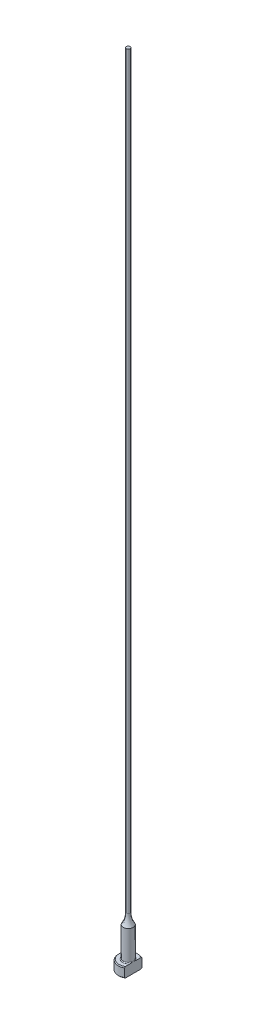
ISO-10303-21;
HEADER;
FILE_DESCRIPTION(('STEP AP214'),'2;1');
FILE_NAME('part.step','',(''),(''),'','','');
FILE_SCHEMA(('AUTOMOTIVE_DESIGN { 1 0 10303 214 1 1 1 1 }'));
ENDSEC;
DATA;
#1=APPLICATION_CONTEXT('core data for automotive mechanical design processes');
#2=APPLICATION_PROTOCOL_DEFINITION('international standard','automotive_design',2000,#1);
#3=PRODUCT_CONTEXT('',#1,'mechanical');
#4=PRODUCT('Part','Part','',(#3));
#5=PRODUCT_RELATED_PRODUCT_CATEGORY('part','',(#4));
#6=PRODUCT_DEFINITION_FORMATION('','',#4);
#7=PRODUCT_DEFINITION_CONTEXT('part definition',#1,'design');
#8=PRODUCT_DEFINITION('design','',#6,#7);
#9=PRODUCT_DEFINITION_SHAPE('','',#8);
#10=(LENGTH_UNIT() NAMED_UNIT(*) SI_UNIT(.MILLI.,.METRE.));
#11=(NAMED_UNIT(*) PLANE_ANGLE_UNIT() SI_UNIT($,.RADIAN.));
#12=(NAMED_UNIT(*) SI_UNIT($,.STERADIAN.) SOLID_ANGLE_UNIT());
#13=UNCERTAINTY_MEASURE_WITH_UNIT(LENGTH_MEASURE(1.E-05),#10,'distance_accuracy_value','');
#14=(GEOMETRIC_REPRESENTATION_CONTEXT(3) GLOBAL_UNCERTAINTY_ASSIGNED_CONTEXT((#13)) GLOBAL_UNIT_ASSIGNED_CONTEXT((#10,
#11,#12)) REPRESENTATION_CONTEXT('',''));
#15=CARTESIAN_POINT('',(0.,0.,0.));
#16=DIRECTION('',(0.,0.,1.));
#17=DIRECTION('',(1.,0.,0.));
#18=AXIS2_PLACEMENT_3D('',#15,#16,#17);
#19=CARTESIAN_POINT('',(-3.17499999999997,3.175,0.));
#20=DIRECTION('',(0.,1.,0.));
#21=DIRECTION('',(0.,0.,1.));
#22=AXIS2_PLACEMENT_3D('',#19,#20,#21);
#23=PLANE('',#22);
#24=CARTESIAN_POINT('',(0.,3.175,0.));
#25=DIRECTION('',(0.,1.,0.));
#26=DIRECTION('',(0.,0.,1.));
#27=AXIS2_PLACEMENT_3D('',#24,#25,#26);
#28=CIRCLE('',#27,2.92099999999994);
#29=CARTESIAN_POINT('',(1.58749999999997,3.175,-2.45195529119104));
#30=VERTEX_POINT('',#29);
#31=CARTESIAN_POINT('',(1.58749999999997,3.175,2.45195529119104));
#32=VERTEX_POINT('',#31);
#33=EDGE_CURVE('E105',#30,#32,#28,.T.);
#34=ORIENTED_EDGE('',*,*,#33,.T.);
#35=DIRECTION('',(0.,0.,1.));
#36=VECTOR('',#35,1.);
#37=CARTESIAN_POINT('',(1.58749999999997,3.17499999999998,2.74963065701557));
#38=LINE('',#37,#36);
#39=CARTESIAN_POINT('',(1.58749999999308,3.175,0.933255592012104));
#40=VERTEX_POINT('',#39);
#41=EDGE_CURVE('E126',#40,#32,#38,.T.);
#42=ORIENTED_EDGE('',*,*,#41,.F.);
#43=CARTESIAN_POINT('',(0.,3.175,0.));
#44=DIRECTION('',(0.,1.,0.));
#45=DIRECTION('',(0.,0.,1.));
#46=AXIS2_PLACEMENT_3D('',#43,#44,#45);
#47=CIRCLE('',#46,1.84149999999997);
#48=CARTESIAN_POINT('',(1.58749999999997,3.17500000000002,-0.933255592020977));
#49=VERTEX_POINT('',#48);
#50=EDGE_CURVE('E11',#40,#49,#47,.F.);
#51=ORIENTED_EDGE('',*,*,#50,.T.);
#52=EDGE_CURVE('E52',#30,#49,#38,.T.);
#53=ORIENTED_EDGE('',*,*,#52,.F.);
#54=EDGE_LOOP('',(#34,#42,#51,#53));
#55=FACE_BOUND('',#54,.T.);
#56=ADVANCED_FACE('F32',(#55),#23,.T.);
#57=CARTESIAN_POINT('',(0.,259.958771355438,0.));
#58=DIRECTION('',(0.,1.,0.));
#59=DIRECTION('',(0.,0.,1.));
#60=AXIS2_PLACEMENT_3D('',#57,#58,#59);
#61=CYLINDRICAL_SURFACE('',#60,3.17499999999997);
#62=CARTESIAN_POINT('',(0.,2.92100000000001,0.));
#63=DIRECTION('',(0.,1.,0.));
#64=DIRECTION('',(0.,0.,1.));
#65=AXIS2_PLACEMENT_3D('',#62,#63,#64);
#66=CIRCLE('',#65,3.17499999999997);
#67=CARTESIAN_POINT('',(1.58749999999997,2.92100000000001,2.74963065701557));
#68=VERTEX_POINT('',#67);
#69=CARTESIAN_POINT('',(1.58749999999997,2.92100000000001,-2.74963065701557));
#70=VERTEX_POINT('',#69);
#71=EDGE_CURVE('E98',#68,#70,#66,.F.);
#72=ORIENTED_EDGE('',*,*,#71,.T.);
#73=DIRECTION('',(0.,-1.,0.));
#74=VECTOR('',#73,1.);
#75=CARTESIAN_POINT('',(1.58749999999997,254.001,-2.74963065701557));
#76=LINE('',#75,#74);
#77=CARTESIAN_POINT('',(1.58749999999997,0.253999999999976,-2.74963065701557));
#78=VERTEX_POINT('',#77);
#79=EDGE_CURVE('E141',#70,#78,#76,.T.);
#80=ORIENTED_EDGE('',*,*,#79,.T.);
#81=CARTESIAN_POINT('',(0.,0.253999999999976,0.));
#82=DIRECTION('',(0.,-1.,0.));
#83=DIRECTION('',(0.,0.,-1.));
#84=AXIS2_PLACEMENT_3D('',#81,#82,#83);
#85=CIRCLE('',#84,3.17499999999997);
#86=CARTESIAN_POINT('',(1.58749999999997,0.253999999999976,2.74963065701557));
#87=VERTEX_POINT('',#86);
#88=EDGE_CURVE('E95',#78,#87,#85,.F.);
#89=ORIENTED_EDGE('',*,*,#88,.T.);
#90=DIRECTION('',(0.,-1.,0.));
#91=VECTOR('',#90,1.);
#92=CARTESIAN_POINT('',(1.58749999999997,254.001,2.74963065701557));
#93=LINE('',#92,#91);
#94=EDGE_CURVE('E88',#68,#87,#93,.T.);
#95=ORIENTED_EDGE('',*,*,#94,.F.);
#96=EDGE_LOOP('',(#72,#80,#89,#95));
#97=FACE_BOUND('',#96,.T.);
#98=ADVANCED_FACE('F191',(#97),#61,.T.);
#99=CARTESIAN_POINT('',(0.,0.,0.));
#100=DIRECTION('',(0.,-1.,0.));
#101=DIRECTION('',(0.,0.,-1.));
#102=AXIS2_PLACEMENT_3D('',#99,#100,#101);
#103=PLANE('',#102);
#104=CARTESIAN_POINT('',(0.,0.,0.));
#105=DIRECTION('',(0.,-1.,0.));
#106=DIRECTION('',(0.,0.,-1.));
#107=AXIS2_PLACEMENT_3D('',#104,#105,#106);
#108=CIRCLE('',#107,2.92100000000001);
#109=CARTESIAN_POINT('',(1.58749999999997,0.,2.45195529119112));
#110=VERTEX_POINT('',#109);
#111=CARTESIAN_POINT('',(1.58749999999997,0.,-2.45195529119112));
#112=VERTEX_POINT('',#111);
#113=EDGE_CURVE('E93',#110,#112,#108,.T.);
#114=ORIENTED_EDGE('',*,*,#113,.T.);
#115=DIRECTION('',(0.,0.,1.));
#116=VECTOR('',#115,1.);
#117=CARTESIAN_POINT('',(1.58749999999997,0.,2.74963065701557));
#118=LINE('',#117,#116);
#119=EDGE_CURVE('E78',#112,#110,#118,.T.);
#120=ORIENTED_EDGE('',*,*,#119,.T.);
#121=EDGE_LOOP('',(#114,#120));
#122=FACE_BOUND('',#121,.T.);
#123=ADVANCED_FACE('F97',(#122),#103,.T.);
#124=CARTESIAN_POINT('',(0.,3.17499999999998,0.));
#125=DIRECTION('',(0.,-1.,0.));
#126=DIRECTION('',(0.,0.,-1.));
#127=AXIS2_PLACEMENT_3D('',#124,#125,#126);
#128=CONICAL_SURFACE('',#127,2.92099999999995,0.785398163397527);
#129=ORIENTED_EDGE('',*,*,#71,.F.);
#130=CARTESIAN_POINT('',(1.58749999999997,-0.16162066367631,-6.0529050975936));
#131=CARTESIAN_POINT('',(1.58749999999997,-0.0288893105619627,-5.91567682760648));
#132=CARTESIAN_POINT('',(1.58749999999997,0.103699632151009,-5.7783103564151));
#133=CARTESIAN_POINT('',(1.58749999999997,0.368508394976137,-5.50321874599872));
#134=CARTESIAN_POINT('',(1.58749999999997,0.500728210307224,-5.36549360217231));
#135=CARTESIAN_POINT('',(1.58749999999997,0.764778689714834,-5.08953516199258));
#136=CARTESIAN_POINT('',(1.58749999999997,0.896609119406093,-4.9513016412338));
#137=CARTESIAN_POINT('',(1.58749999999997,1.15968706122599,-4.67428233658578));
#138=CARTESIAN_POINT('',(1.58749999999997,1.29093457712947,-4.53549655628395));
#139=CARTESIAN_POINT('',(1.58749999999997,1.55007705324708,-4.25997724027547));
#140=CARTESIAN_POINT('',(1.58749999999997,1.67798684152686,-4.12325766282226));
#141=CARTESIAN_POINT('',(1.58749999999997,1.9328486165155,-3.84892898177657));
#142=CARTESIAN_POINT('',(1.58749999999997,2.05980060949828,-3.71131988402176));
#143=CARTESIAN_POINT('',(1.58749999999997,2.31237508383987,-3.43493978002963));
#144=CARTESIAN_POINT('',(1.58749999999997,2.43799784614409,-3.29616903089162));
#145=CARTESIAN_POINT('',(1.58749999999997,2.68741369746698,-3.01699558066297));
#146=CARTESIAN_POINT('',(1.58749999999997,2.81120686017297,-2.8765929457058));
#147=CARTESIAN_POINT('',(1.58749999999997,3.00875865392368,-2.64816703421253));
#148=CARTESIAN_POINT('',(1.58749999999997,3.08336151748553,-2.56087478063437));
#149=CARTESIAN_POINT('',(1.58749999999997,3.2312387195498,-2.38515423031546));
#150=CARTESIAN_POINT('',(1.58749999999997,3.30451292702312,-2.29672582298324));
#151=CARTESIAN_POINT('',(1.58749999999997,3.45004422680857,-2.1174740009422));
#152=CARTESIAN_POINT('',(1.58749999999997,3.5222823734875,-2.02663514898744));
#153=CARTESIAN_POINT('',(1.58749999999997,3.66423097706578,-1.8430252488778));
#154=CARTESIAN_POINT('',(1.58749999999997,3.73394203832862,-1.75025467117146));
#155=CARTESIAN_POINT('',(1.58749999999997,3.87080633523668,-1.5606747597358));
#156=CARTESIAN_POINT('',(1.58749999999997,3.93790459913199,-1.46382547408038));
#157=CARTESIAN_POINT('',(1.58749999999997,4.06669147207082,-1.26632594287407));
#158=CARTESIAN_POINT('',(1.58749999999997,4.1283726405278,-1.16567073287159));
#159=CARTESIAN_POINT('',(1.58749999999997,4.21402252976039,-1.01165766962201));
#160=CARTESIAN_POINT('',(1.58749999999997,4.24127929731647,-0.960142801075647));
#161=CARTESIAN_POINT('',(1.58749999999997,4.2930979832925,-0.855780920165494));
#162=CARTESIAN_POINT('',(1.58749999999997,4.31765941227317,-0.802933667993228));
#163=CARTESIAN_POINT('',(1.58749999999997,4.38614656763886,-0.642461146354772));
#164=CARTESIAN_POINT('',(1.58749999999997,4.42510149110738,-0.532518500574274));
#165=CARTESIAN_POINT('',(1.58749999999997,4.46726244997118,-0.367680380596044));
#166=CARTESIAN_POINT('',(1.58749999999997,4.47844427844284,-0.314802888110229));
#167=CARTESIAN_POINT('',(1.58749999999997,4.49576654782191,-0.208209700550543));
#168=CARTESIAN_POINT('',(1.58749999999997,4.50190743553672,-0.154494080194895));
#169=CARTESIAN_POINT('',(1.58749999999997,4.50871296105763,-0.0468792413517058));
#170=CARTESIAN_POINT('',(1.58749999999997,4.5093945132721,0.00701889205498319));
#171=CARTESIAN_POINT('',(1.58749999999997,4.50527679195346,0.114606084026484));
#172=CARTESIAN_POINT('',(1.58749999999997,4.50047706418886,0.168295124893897));
#173=CARTESIAN_POINT('',(1.58749999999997,4.48579689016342,0.27448544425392));
#174=CARTESIAN_POINT('',(1.58749999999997,4.47596081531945,0.32699298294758));
#175=CARTESIAN_POINT('',(1.58749999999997,4.45181809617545,0.430974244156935));
#176=CARTESIAN_POINT('',(1.58749999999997,4.4375096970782,0.482447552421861));
#177=CARTESIAN_POINT('',(1.58749999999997,4.40502489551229,0.584460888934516));
#178=CARTESIAN_POINT('',(1.58749999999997,4.386827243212,0.634994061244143));
#179=CARTESIAN_POINT('',(1.58749999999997,4.34729308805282,0.734789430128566));
#180=CARTESIAN_POINT('',(1.58749999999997,4.3259572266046,0.784051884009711));
#181=CARTESIAN_POINT('',(1.58749999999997,4.25791922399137,0.930549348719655));
#182=CARTESIAN_POINT('',(1.58749999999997,4.20736047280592,1.0259880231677));
#183=CARTESIAN_POINT('',(1.58749999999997,4.0995545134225,1.21304313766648));
#184=CARTESIAN_POINT('',(1.58749999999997,4.04229912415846,1.30465471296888));
#185=CARTESIAN_POINT('',(1.58749999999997,3.92308746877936,1.48526211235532));
#186=CARTESIAN_POINT('',(1.58749999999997,3.86111349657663,1.57424615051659));
#187=CARTESIAN_POINT('',(1.58749999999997,3.73408621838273,1.74990003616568));
#188=CARTESIAN_POINT('',(1.58749999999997,3.66903444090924,1.83657099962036));
#189=CARTESIAN_POINT('',(1.58749999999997,3.53583371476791,2.00931764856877));
#190=CARTESIAN_POINT('',(1.58749999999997,3.46765527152,2.09537048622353));
#191=CARTESIAN_POINT('',(1.58749999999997,3.32960643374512,2.26611736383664));
#192=CARTESIAN_POINT('',(1.58749999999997,3.25973586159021,2.35081125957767));
#193=CARTESIAN_POINT('',(1.58749999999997,3.04858139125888,2.60290121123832));
#194=CARTESIAN_POINT('',(1.58749999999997,2.90542388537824,2.76872537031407));
#195=CARTESIAN_POINT('',(1.58749999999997,2.64069522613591,3.06970913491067));
#196=CARTESIAN_POINT('',(1.58749999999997,2.51959458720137,3.20528660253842));
#197=CARTESIAN_POINT('',(1.58749999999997,2.27590400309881,3.47510321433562));
#198=CARTESIAN_POINT('',(1.58749999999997,2.15331401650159,3.60934232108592));
#199=CARTESIAN_POINT('',(1.58749999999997,1.90694239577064,3.87695374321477));
#200=CARTESIAN_POINT('',(1.58749999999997,1.78315974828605,4.0103251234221));
#201=CARTESIAN_POINT('',(1.58749999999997,1.53478104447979,4.27630880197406));
#202=CARTESIAN_POINT('',(1.58749999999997,1.41018498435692,4.40892109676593));
#203=CARTESIAN_POINT('',(1.58749999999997,1.0457468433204,4.79499418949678));
#204=CARTESIAN_POINT('',(1.58749999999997,0.80507680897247,5.04767313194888));
#205=CARTESIAN_POINT('',(1.58749999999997,0.443121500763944,5.42550911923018));
#206=CARTESIAN_POINT('',(1.58749999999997,0.322378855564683,5.55118772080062));
#207=CARTESIAN_POINT('',(1.58749999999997,0.0805914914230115,5.80225207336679));
#208=CARTESIAN_POINT('',(1.58749999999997,-0.040453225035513,5.92763782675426));
#209=CARTESIAN_POINT('',(1.58749999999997,-0.161620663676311,6.0529050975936));
#210=B_SPLINE_CURVE_WITH_KNOTS('',3,(#130,#131,#132,#133,#134,#135,#136,#137,#138,#139,#140,
#141,#142,#143,#144,#145,#146,#147,#148,#149,#150,#151,#152,#153,#154,#155,#156,#157,#158,#159,
#160,#161,#162,#163,#164,#165,#166,#167,#168,#169,#170,#171,#172,#173,#174,#175,#176,#177,#178,
#179,#180,#181,#182,#183,#184,#185,#186,#187,#188,#189,#190,#191,#192,#193,#194,#195,#196,#197,
#198,#199,#200,#201,#202,#203,#204,#205,#206,#207,#208,#209),.UNSPECIFIED.,.F.,.F.,(4,2,2,2,2,2,
2,2,2,2,2,2,2,2,2,2,2,2,2,2,2,2,2,2,2,2,2,2,2,2,2,2,2,2,2,2,2,2,2,4),(0.,0.572750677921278,
1.14550874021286,1.71856057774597,2.29160869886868,2.85328006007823,3.4149477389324,
3.97649423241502,4.53801804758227,4.88249307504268,5.22700189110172,5.5751532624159,
5.92322081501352,6.27657800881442,6.63041319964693,6.80518126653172,6.9799810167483,
7.3282426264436,7.49018491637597,7.65211285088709,7.81353889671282,7.97497832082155,
8.13501929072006,8.29512313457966,8.45612518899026,8.61709438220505,8.94062993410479,
9.2645649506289,9.58978187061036,9.91483894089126,10.2441741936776,10.5735441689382,
11.2306812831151,11.7760337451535,12.3214014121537,12.8672825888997,13.4131663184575,
14.4600164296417,14.9828595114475,15.5056983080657),.UNSPECIFIED.);
#211=EDGE_CURVE('E118',#32,#68,#210,.T.);
#212=ORIENTED_EDGE('',*,*,#211,.F.);
#213=ORIENTED_EDGE('',*,*,#33,.F.);
#214=EDGE_CURVE('E117',#70,#30,#210,.T.);
#215=ORIENTED_EDGE('',*,*,#214,.F.);
#216=EDGE_LOOP('',(#129,#212,#213,#215));
#217=FACE_BOUND('',#216,.T.);
#218=ADVANCED_FACE('F162',(#217),#128,.T.);
#219=CARTESIAN_POINT('',(0.,0.253999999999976,0.));
#220=DIRECTION('',(0.,1.,0.));
#221=DIRECTION('',(0.,0.,1.));
#222=AXIS2_PLACEMENT_3D('',#219,#220,#221);
#223=CONICAL_SURFACE('',#222,3.17499999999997,0.785398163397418);
#224=ORIENTED_EDGE('',*,*,#88,.F.);
#225=CARTESIAN_POINT('',(1.58749999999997,3.33662066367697,6.0529050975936));
#226=CARTESIAN_POINT('',(1.58749999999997,3.20388931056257,5.91567682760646));
#227=CARTESIAN_POINT('',(1.58749999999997,3.07130036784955,5.77831035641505));
#228=CARTESIAN_POINT('',(1.58749999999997,2.80649160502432,5.50321874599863));
#229=CARTESIAN_POINT('',(1.58749999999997,2.67427178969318,5.3654936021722));
#230=CARTESIAN_POINT('',(1.58749999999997,2.41022131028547,5.08953516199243));
#231=CARTESIAN_POINT('',(1.58749999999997,2.27839088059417,4.95130164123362));
#232=CARTESIAN_POINT('',(1.58749999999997,2.01531293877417,4.67428233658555));
#233=CARTESIAN_POINT('',(1.58749999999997,1.88406542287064,4.5354965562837));
#234=CARTESIAN_POINT('',(1.58749999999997,1.62492294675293,4.25997724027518));
#235=CARTESIAN_POINT('',(1.58749999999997,1.49701315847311,4.12325766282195));
#236=CARTESIAN_POINT('',(1.58749999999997,1.24215138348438,3.84892898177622));
#237=CARTESIAN_POINT('',(1.58749999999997,1.11519939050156,3.71131988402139));
#238=CARTESIAN_POINT('',(1.58749999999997,0.862624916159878,3.43493978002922));
#239=CARTESIAN_POINT('',(1.58749999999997,0.737002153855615,3.29616903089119));
#240=CARTESIAN_POINT('',(1.58749999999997,0.487586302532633,3.01699558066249));
#241=CARTESIAN_POINT('',(1.58749999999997,0.363793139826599,2.8765929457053));
#242=CARTESIAN_POINT('',(1.58749999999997,0.166241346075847,2.64816703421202));
#243=CARTESIAN_POINT('',(1.58749999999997,0.0916384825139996,2.56087478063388));
#244=CARTESIAN_POINT('',(1.58749999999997,-0.0562387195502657,2.385154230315));
#245=CARTESIAN_POINT('',(1.58749999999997,-0.129512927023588,2.29672582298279));
#246=CARTESIAN_POINT('',(1.58749999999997,-0.27504422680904,2.11747400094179));
#247=CARTESIAN_POINT('',(1.58749999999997,-0.347282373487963,2.02663514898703));
#248=CARTESIAN_POINT('',(1.58749999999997,-0.489230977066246,1.84302524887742));
#249=CARTESIAN_POINT('',(1.58749999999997,-0.558942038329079,1.7502546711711));
#250=CARTESIAN_POINT('',(1.58749999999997,-0.695806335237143,1.56067475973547));
#251=CARTESIAN_POINT('',(1.58749999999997,-0.762904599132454,1.46382547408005));
#252=CARTESIAN_POINT('',(1.58749999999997,-0.891691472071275,1.26632594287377));
#253=CARTESIAN_POINT('',(1.58749999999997,-0.953372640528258,1.16567073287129));
#254=CARTESIAN_POINT('',(1.58749999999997,-1.03902252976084,1.01165766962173));
#255=CARTESIAN_POINT('',(1.58749999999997,-1.06627929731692,0.960142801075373));
#256=CARTESIAN_POINT('',(1.58749999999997,-1.11809798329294,0.85578092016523));
#257=CARTESIAN_POINT('',(1.58749999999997,-1.14265941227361,0.802933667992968));
#258=CARTESIAN_POINT('',(1.58749999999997,-1.21114656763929,0.642461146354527));
#259=CARTESIAN_POINT('',(1.58749999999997,-1.2501014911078,0.532518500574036));
#260=CARTESIAN_POINT('',(1.58749999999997,-1.29226244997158,0.367680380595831));
#261=CARTESIAN_POINT('',(1.58749999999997,-1.30344427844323,0.314802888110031));
#262=CARTESIAN_POINT('',(1.58749999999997,-1.32076654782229,0.208209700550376));
#263=CARTESIAN_POINT('',(1.58749999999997,-1.3269074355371,0.154494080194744));
#264=CARTESIAN_POINT('',(1.58749999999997,-1.333712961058,0.0468792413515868));
#265=CARTESIAN_POINT('',(1.58749999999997,-1.33439451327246,-0.00701889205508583));
#266=CARTESIAN_POINT('',(1.58749999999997,-1.33027679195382,-0.114606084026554));
#267=CARTESIAN_POINT('',(1.58749999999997,-1.32547706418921,-0.168295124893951));
#268=CARTESIAN_POINT('',(1.58749999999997,-1.31079689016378,-0.274485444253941));
#269=CARTESIAN_POINT('',(1.58749999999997,-1.3009608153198,-0.326992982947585));
#270=CARTESIAN_POINT('',(1.58749999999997,-1.27681809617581,-0.430974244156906));
#271=CARTESIAN_POINT('',(1.58749999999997,-1.26250969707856,-0.482447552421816));
#272=CARTESIAN_POINT('',(1.58749999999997,-1.23002489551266,-0.584460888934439));
#273=CARTESIAN_POINT('',(1.58749999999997,-1.21182724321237,-0.634994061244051));
#274=CARTESIAN_POINT('',(1.58749999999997,-1.1722930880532,-0.734789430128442));
#275=CARTESIAN_POINT('',(1.58749999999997,-1.15095722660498,-0.784051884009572));
#276=CARTESIAN_POINT('',(1.58749999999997,-1.08291922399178,-0.93054934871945));
#277=CARTESIAN_POINT('',(1.58749999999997,-1.03236047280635,-1.02598802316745));
#278=CARTESIAN_POINT('',(1.58749999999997,-0.924554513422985,-1.21304313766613));
#279=CARTESIAN_POINT('',(1.58749999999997,-0.86729912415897,-1.30465471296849));
#280=CARTESIAN_POINT('',(1.58749999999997,-0.748087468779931,-1.48526211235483));
#281=CARTESIAN_POINT('',(1.58749999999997,-0.686113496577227,-1.57424615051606));
#282=CARTESIAN_POINT('',(1.58749999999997,-0.55908621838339,-1.74990003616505));
#283=CARTESIAN_POINT('',(1.58749999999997,-0.494034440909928,-1.83657099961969));
#284=CARTESIAN_POINT('',(1.58749999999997,-0.360833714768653,-2.00931764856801));
#285=CARTESIAN_POINT('',(1.58749999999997,-0.292655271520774,-2.09537048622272));
#286=CARTESIAN_POINT('',(1.58749999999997,-0.154606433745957,-2.26611736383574));
#287=CARTESIAN_POINT('',(1.58749999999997,-0.0847358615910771,-2.35081125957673));
#288=CARTESIAN_POINT('',(1.58749999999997,0.126418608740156,-2.60290121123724));
#289=CARTESIAN_POINT('',(1.58749999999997,0.269576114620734,-2.76872537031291));
#290=CARTESIAN_POINT('',(1.58749999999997,0.534304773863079,-3.06970913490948));
#291=CARTESIAN_POINT('',(1.58749999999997,0.655405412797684,-3.20528660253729));
#292=CARTESIAN_POINT('',(1.58749999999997,0.899095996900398,-3.47510321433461));
#293=CARTESIAN_POINT('',(1.58749999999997,1.02168598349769,-3.60934232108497));
#294=CARTESIAN_POINT('',(1.58749999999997,1.26805760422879,-3.87695374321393));
#295=CARTESIAN_POINT('',(1.58749999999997,1.39184025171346,-4.01032512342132));
#296=CARTESIAN_POINT('',(1.58749999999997,1.64021895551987,-4.2763088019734));
#297=CARTESIAN_POINT('',(1.58749999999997,1.76481501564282,-4.40892109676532));
#298=CARTESIAN_POINT('',(1.58749999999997,2.12925315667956,-4.79499418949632));
#299=CARTESIAN_POINT('',(1.58749999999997,2.36992319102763,-5.04767313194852));
#300=CARTESIAN_POINT('',(1.58749999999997,2.73187849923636,-5.42550911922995));
#301=CARTESIAN_POINT('',(1.58749999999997,2.85262114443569,-5.55118772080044));
#302=CARTESIAN_POINT('',(1.58749999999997,3.09440850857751,-5.8022520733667));
#303=CARTESIAN_POINT('',(1.58749999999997,3.2154532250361,-5.92763782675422));
#304=CARTESIAN_POINT('',(1.58749999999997,3.33662066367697,-6.0529050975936));
#305=B_SPLINE_CURVE_WITH_KNOTS('',3,(#225,#226,#227,#228,#229,#230,#231,#232,#233,#234,#235,
#236,#237,#238,#239,#240,#241,#242,#243,#244,#245,#246,#247,#248,#249,#250,#251,#252,#253,#254,
#255,#256,#257,#258,#259,#260,#261,#262,#263,#264,#265,#266,#267,#268,#269,#270,#271,#272,#273,
#274,#275,#276,#277,#278,#279,#280,#281,#282,#283,#284,#285,#286,#287,#288,#289,#290,#291,#292,
#293,#294,#295,#296,#297,#298,#299,#300,#301,#302,#303,#304),.UNSPECIFIED.,.F.,.F.,(4,2,2,2,2,2,
2,2,2,2,2,2,2,2,2,2,2,2,2,2,2,2,2,2,2,2,2,2,2,2,2,2,2,2,2,2,2,2,2,4),(0.,0.57275067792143,
1.14550874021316,1.71856057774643,2.29160869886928,2.85328006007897,3.41494773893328,
3.97649423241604,4.53801804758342,4.88249307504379,5.2270018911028,5.57515326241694,
5.92322081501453,6.27657800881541,6.63041319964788,6.80518126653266,6.97998101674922,
7.32824262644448,7.49018491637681,7.65211285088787,7.81353889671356,7.97497832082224,
8.1350192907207,8.29512313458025,8.45612518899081,8.61709438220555,8.94062993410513,
9.26456495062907,9.58978187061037,9.91483894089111,10.2441741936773,10.5735441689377,
11.2306812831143,11.776033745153,12.3214014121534,12.8672825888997,13.4131663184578,
14.4600164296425,14.9828595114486,15.505698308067),.UNSPECIFIED.);
#306=EDGE_CURVE('E81',#112,#78,#305,.T.);
#307=ORIENTED_EDGE('',*,*,#306,.F.);
#308=ORIENTED_EDGE('',*,*,#113,.F.);
#309=EDGE_CURVE('E84',#87,#110,#305,.T.);
#310=ORIENTED_EDGE('',*,*,#309,.F.);
#311=EDGE_LOOP('',(#224,#307,#308,#310));
#312=FACE_BOUND('',#311,.T.);
#313=ADVANCED_FACE('F92',(#312),#223,.T.);
#314=CARTESIAN_POINT('',(0.,3.42900000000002,0.));
#315=DIRECTION('',(0.,1.,0.));
#316=DIRECTION('',(0.,0.,1.));
#317=AXIS2_PLACEMENT_3D('',#314,#315,#316);
#318=TOROIDAL_SURFACE('',#317,1.84149999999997,0.254);
#319=CARTESIAN_POINT('',(1.58749999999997,3.42900000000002,0.));
#320=CARTESIAN_POINT('',(1.58749999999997,3.42899942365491,-1.9220514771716E-10));
#321=CARTESIAN_POINT('',(1.58749999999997,3.42899884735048,-1.2261161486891E-07));
#322=CARTESIAN_POINT('',(1.58749999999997,3.42899773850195,-5.09676365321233E-07));
#323=CARTESIAN_POINT('',(1.58749999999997,3.42899720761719,-7.78176328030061E-07));
#324=CARTESIAN_POINT('',(1.58749999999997,3.42899614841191,-1.42307272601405E-06));
#325=CARTESIAN_POINT('',(1.58749999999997,3.42899562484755,-1.80713867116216E-06));
#326=CARTESIAN_POINT('',(1.58749999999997,3.42899463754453,-2.63494846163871E-06));
#327=CARTESIAN_POINT('',(1.58749999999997,3.42899417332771,-3.07814756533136E-06));
#328=CARTESIAN_POINT('',(1.58749999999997,3.42899261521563,-4.66897357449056E-06));
#329=CARTESIAN_POINT('',(1.58749999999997,3.42899159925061,-5.89404908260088E-06));
#330=CARTESIAN_POINT('',(1.58749999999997,3.42898979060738,-8.42427511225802E-06));
#331=CARTESIAN_POINT('',(1.58749999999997,3.42898899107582,-9.7248057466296E-06));
#332=CARTESIAN_POINT('',(1.58749999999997,3.42898598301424,-1.48060601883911E-05));
#333=CARTESIAN_POINT('',(1.58749999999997,3.42898393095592,-1.86838281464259E-05));
#334=CARTESIAN_POINT('',(1.58749999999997,3.42898057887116,-2.63261117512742E-05));
#335=CARTESIAN_POINT('',(1.58749999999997,3.42897922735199,-3.00687417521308E-05));
#336=CARTESIAN_POINT('',(1.58749999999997,3.42897347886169,-4.60276298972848E-05));
#337=CARTESIAN_POINT('',(1.58749999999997,3.42896911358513,-5.8247019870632E-05));
#338=CARTESIAN_POINT('',(1.58749999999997,3.42896211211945,-8.11070097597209E-05));
#339=CARTESIAN_POINT('',(1.58749999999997,3.42895931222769,-9.16953114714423E-05));
#340=CARTESIAN_POINT('',(1.58749999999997,3.42893712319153,-0.000168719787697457));
#341=CARTESIAN_POINT('',(1.58749999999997,3.42890881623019,-0.000232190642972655));
#342=CARTESIAN_POINT('',(1.58749999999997,3.42880276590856,-0.000479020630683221));
#343=CARTESIAN_POINT('',(1.58749999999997,3.42873165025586,-0.00066443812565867));
#344=CARTESIAN_POINT('',(1.58749999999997,3.42845137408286,-0.0013844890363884));
#345=CARTESIAN_POINT('',(1.58749999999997,3.42823526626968,-0.00191701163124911));
#346=CARTESIAN_POINT('',(1.58749999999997,3.42735449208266,-0.00409774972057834));
#347=CARTESIAN_POINT('',(1.58749999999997,3.42669768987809,-0.00574830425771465));
#348=CARTESIAN_POINT('',(1.58749999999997,3.4174405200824,-0.0289985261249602));
#349=CARTESIAN_POINT('',(1.58749999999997,3.40878325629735,-0.0505816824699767));
#350=CARTESIAN_POINT('',(1.58749999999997,3.39189297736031,-0.0929947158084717));
#351=CARTESIAN_POINT('',(1.58749999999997,3.38365605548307,-0.11382315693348));
#352=CARTESIAN_POINT('',(1.58749999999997,3.36635393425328,-0.157956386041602));
#353=CARTESIAN_POINT('',(1.58749999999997,3.35730391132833,-0.181267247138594));
#354=CARTESIAN_POINT('',(1.58749999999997,3.33936775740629,-0.228222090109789));
#355=CARTESIAN_POINT('',(1.58749999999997,3.33048420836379,-0.25186705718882));
#356=CARTESIAN_POINT('',(1.58749999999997,3.30894496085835,-0.310512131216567));
#357=CARTESIAN_POINT('',(1.58749999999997,3.29649449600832,-0.345588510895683));
#358=CARTESIAN_POINT('',(1.58749999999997,3.27296975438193,-0.415278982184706));
#359=CARTESIAN_POINT('',(1.58749999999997,3.26186987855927,-0.449884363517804));
#360=CARTESIAN_POINT('',(1.58749999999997,3.2395832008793,-0.524471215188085));
#361=CARTESIAN_POINT('',(1.58749999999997,3.22860862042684,-0.564517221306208));
#362=CARTESIAN_POINT('',(1.58749999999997,3.20902534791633,-0.645529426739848));
#363=CARTESIAN_POINT('',(1.58749999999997,3.20043582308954,-0.686500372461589));
#364=CARTESIAN_POINT('',(1.58749999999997,3.18611712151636,-0.771546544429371));
#365=CARTESIAN_POINT('',(1.58749999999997,3.18059550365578,-0.815658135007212));
#366=CARTESIAN_POINT('',(1.58749999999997,3.17455396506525,-0.904117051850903));
#367=CARTESIAN_POINT('',(1.58749999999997,3.17401361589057,-0.948462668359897));
#368=CARTESIAN_POINT('',(1.58749999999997,3.17898948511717,-1.02531896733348));
#369=CARTESIAN_POINT('',(1.58749999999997,3.1829739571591,-1.05792141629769));
#370=CARTESIAN_POINT('',(1.58749999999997,3.19569167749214,-1.12184393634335));
#371=CARTESIAN_POINT('',(1.58749999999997,3.20436049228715,-1.1531753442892));
#372=CARTESIAN_POINT('',(1.58749999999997,3.22236152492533,-1.19946468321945));
#373=CARTESIAN_POINT('',(1.58749999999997,3.2295150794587,-1.21526783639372));
#374=CARTESIAN_POINT('',(1.58749999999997,3.24587062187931,-1.24583726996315));
#375=CARTESIAN_POINT('',(1.58749999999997,3.25507530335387,-1.26060215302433));
#376=CARTESIAN_POINT('',(1.58749999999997,3.27378481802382,-1.28575815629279));
#377=CARTESIAN_POINT('',(1.58749999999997,3.28289001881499,-1.29644383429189));
#378=CARTESIAN_POINT('',(1.58749999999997,3.30268460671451,-1.31623154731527));
#379=CARTESIAN_POINT('',(1.58749999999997,3.31337067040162,-1.32533681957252));
#380=CARTESIAN_POINT('',(1.58749999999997,3.33349977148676,-1.33941140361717));
#381=CARTESIAN_POINT('',(1.58749999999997,3.34261446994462,-1.34484814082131));
#382=CARTESIAN_POINT('',(1.58749999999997,3.36161455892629,-1.35416329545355));
#383=CARTESIAN_POINT('',(1.58749999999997,3.37149946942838,-1.35804267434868));
#384=CARTESIAN_POINT('',(1.58749999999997,3.39188678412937,-1.36398436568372));
#385=CARTESIAN_POINT('',(1.58749999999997,3.40239309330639,-1.36603350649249));
#386=CARTESIAN_POINT('',(1.58749999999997,3.42360372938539,-1.3680840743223));
#387=CARTESIAN_POINT('',(1.58749999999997,3.43430795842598,-1.36808648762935));
#388=CARTESIAN_POINT('',(1.58749999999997,3.45433283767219,-1.36616208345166));
#389=CARTESIAN_POINT('',(1.58749999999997,3.46367506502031,-1.36444960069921));
#390=CARTESIAN_POINT('',(1.58749999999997,3.48195519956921,-1.35953338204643));
#391=CARTESIAN_POINT('',(1.58749999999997,3.49089304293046,-1.3563294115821));
#392=CARTESIAN_POINT('',(1.58749999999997,3.50850302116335,-1.34848006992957));
#393=CARTESIAN_POINT('',(1.58749999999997,3.5171531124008,-1.34378578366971));
#394=CARTESIAN_POINT('',(1.58749999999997,3.53371257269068,-1.33324445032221));
#395=CARTESIAN_POINT('',(1.58749999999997,3.54162163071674,-1.32739692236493));
#396=CARTESIAN_POINT('',(1.58749999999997,3.56107121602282,-1.31107304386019));
#397=CARTESIAN_POINT('',(1.58749999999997,3.57202221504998,-1.29989286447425));
#398=CARTESIAN_POINT('',(1.58749999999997,3.59202509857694,-1.27593566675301));
#399=CARTESIAN_POINT('',(1.58749999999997,3.60107086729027,-1.26315370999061));
#400=CARTESIAN_POINT('',(1.58749999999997,3.62186023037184,-1.22930733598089));
#401=CARTESIAN_POINT('',(1.58749999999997,3.63240584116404,-1.20751096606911));
#402=CARTESIAN_POINT('',(1.58749999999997,3.65004643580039,-1.16266144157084));
#403=CARTESIAN_POINT('',(1.58749999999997,3.65714435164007,-1.13960937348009));
#404=CARTESIAN_POINT('',(1.58749999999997,3.67265428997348,-1.07603916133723));
#405=CARTESIAN_POINT('',(1.58749999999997,3.67834921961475,-1.03486686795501));
#406=CARTESIAN_POINT('',(1.58749999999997,3.68382880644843,-0.951558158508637));
#407=CARTESIAN_POINT('',(1.58749999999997,3.68350976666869,-0.909417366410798));
#408=CARTESIAN_POINT('',(1.58749999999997,3.67745397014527,-0.811383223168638));
#409=CARTESIAN_POINT('',(1.58749999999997,3.66993873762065,-0.755610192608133));
#410=CARTESIAN_POINT('',(1.58749999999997,3.64933373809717,-0.644937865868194));
#411=CARTESIAN_POINT('',(1.58749999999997,3.63621897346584,-0.59004364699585));
#412=CARTESIAN_POINT('',(1.58749999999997,3.60740922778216,-0.485757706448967));
#413=CARTESIAN_POINT('',(1.58749999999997,3.59201096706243,-0.436281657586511));
#414=CARTESIAN_POINT('',(1.58749999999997,3.55922497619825,-0.338551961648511));
#415=CARTESIAN_POINT('',(1.58749999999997,3.5418584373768,-0.290291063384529));
#416=CARTESIAN_POINT('',(1.58749999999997,3.51760237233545,-0.225557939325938));
#417=CARTESIAN_POINT('',(1.58749999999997,3.51126413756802,-0.208874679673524));
#418=CARTESIAN_POINT('',(1.58749999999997,3.49830042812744,-0.17512392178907));
#419=CARTESIAN_POINT('',(1.58749999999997,3.49167176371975,-0.158057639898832));
#420=CARTESIAN_POINT('',(1.58749999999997,3.47585523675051,-0.117638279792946));
#421=CARTESIAN_POINT('',(1.58749999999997,3.46662970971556,-0.0943002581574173));
#422=CARTESIAN_POINT('',(1.58749999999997,3.44889695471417,-0.0497824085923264));
#423=CARTESIAN_POINT('',(1.58749999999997,3.44040039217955,-0.028598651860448));
#424=CARTESIAN_POINT('',(1.58749999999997,3.43130364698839,-0.00575168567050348));
#425=CARTESIAN_POINT('',(1.58749999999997,3.43064818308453,-0.00410451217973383));
#426=CARTESIAN_POINT('',(1.58749999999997,3.42976776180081,-0.00192459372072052));
#427=CARTESIAN_POINT('',(1.58749999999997,3.42955062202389,-0.00138952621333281));
#428=CARTESIAN_POINT('',(1.58749999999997,3.42926908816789,-0.000666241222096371));
#429=CARTESIAN_POINT('',(1.58749999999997,3.42919771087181,-0.000480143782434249));
#430=CARTESIAN_POINT('',(1.58749999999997,3.42909131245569,-0.000232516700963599));
#431=CARTESIAN_POINT('',(1.58749999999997,3.42906294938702,-0.000168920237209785));
#432=CARTESIAN_POINT('',(1.58749999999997,3.42904072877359,-9.17527162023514E-05));
#433=CARTESIAN_POINT('',(1.58749999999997,3.42903792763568,-8.11550293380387E-05));
#434=CARTESIAN_POINT('',(1.58749999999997,3.42903091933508,-5.82743948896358E-05));
#435=CARTESIAN_POINT('',(1.58749999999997,3.42902654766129,-4.60440001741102E-05));
#436=CARTESIAN_POINT('',(1.58749999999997,3.42902079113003,-3.00727682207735E-05));
#437=CARTESIAN_POINT('',(1.58749999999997,3.42901943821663,-2.63286807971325E-05));
#438=CARTESIAN_POINT('',(1.58749999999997,3.42901608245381,-1.86836529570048E-05));
#439=CARTESIAN_POINT('',(1.58749999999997,3.4290140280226,-1.48046517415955E-05));
#440=CARTESIAN_POINT('',(1.58749999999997,3.42901101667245,-9.72223943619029E-06));
#441=CARTESIAN_POINT('',(1.58749999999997,3.42901021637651,-8.42159649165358E-06));
#442=CARTESIAN_POINT('',(1.58749999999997,3.42900840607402,-5.89129729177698E-06));
#443=CARTESIAN_POINT('',(1.58749999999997,3.42900738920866,-4.66626867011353E-06));
#444=CARTESIAN_POINT('',(1.58749999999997,3.42900582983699,-3.07568803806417E-06));
#445=CARTESIAN_POINT('',(1.58749999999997,3.42900536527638,-2.63259565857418E-06));
#446=CARTESIAN_POINT('',(1.58749999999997,3.4290043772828,-1.80506085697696E-06));
#447=CARTESIAN_POINT('',(1.58749999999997,3.42900385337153,-1.42116387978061E-06));
#448=CARTESIAN_POINT('',(1.58749999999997,3.42900279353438,-7.76675643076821E-07));
#449=CARTESIAN_POINT('',(1.58749999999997,3.42900226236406,-5.08406487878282E-07));
#450=CARTESIAN_POINT('',(1.58749999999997,3.42900115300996,-1.21901887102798E-07));
#451=CARTESIAN_POINT('',(1.58749999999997,3.42900057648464,1.92251677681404E-10));
#452=CARTESIAN_POINT('',(1.58749999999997,3.42900000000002,0.));
#453=B_SPLINE_CURVE_WITH_KNOTS('',3,(#319,#320,#321,#322,#323,#324,#325,#326,#327,#328,#329,
#330,#331,#332,#333,#334,#335,#336,#337,#338,#339,#340,#341,#342,#343,#344,#345,#346,#347,#348,
#349,#350,#351,#352,#353,#354,#355,#356,#357,#358,#359,#360,#361,#362,#363,#364,#365,#366,#367,
#368,#369,#370,#371,#372,#373,#374,#375,#376,#377,#378,#379,#380,#381,#382,#383,#384,#385,#386,
#387,#388,#389,#390,#391,#392,#393,#394,#395,#396,#397,#398,#399,#400,#401,#402,#403,#404,#405,
#406,#407,#408,#409,#410,#411,#412,#413,#414,#415,#416,#417,#418,#419,#420,#421,#422,#423,#424,
#425,#426,#427,#428,#429,#430,#431,#432,#433,#434,#435,#436,#437,#438,#439,#440,#441,#442,#443,
#444,#445,#446,#447,#448,#449,#450,#451,#452),.UNSPECIFIED.,.T.,.F.,(4,2,2,2,2,2,2,2,2,2,2,2,2,
2,2,2,2,2,2,2,2,2,2,2,2,2,2,2,2,2,2,2,2,2,2,2,2,2,2,2,2,2,2,2,2,2,2,2,2,2,2,2,2,2,2,2,2,2,2,2,2,
2,2,2,2,2,4),(0.,1.72815458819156E-06,3.50429255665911E-06,5.44431004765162E-06,
7.3675525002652E-06,1.2119089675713E-05,1.66953775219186E-05,2.98160400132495E-05,
4.17409564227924E-05,8.0660475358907E-05,0.000113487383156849,0.000321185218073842,
0.000917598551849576,0.00264089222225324,0.00797105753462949,0.0777276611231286,
0.144923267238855,0.219939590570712,0.295714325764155,0.407362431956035,0.516367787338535,
0.640878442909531,0.766362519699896,0.899536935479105,1.03216495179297,1.13045740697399,
1.22743103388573,1.27935899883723,1.33135556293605,1.37333248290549,1.41522237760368,
1.44693946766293,1.47863694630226,1.51056074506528,1.54246916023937,1.57083210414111,
1.59919951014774,1.62861579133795,1.65804436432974,1.70472658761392,1.75155645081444,
1.82378709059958,1.89595619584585,2.01995471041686,2.1460932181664,2.31447224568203,
2.48361094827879,2.6389891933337,2.79283011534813,2.84637031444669,2.9012946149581,
2.97658236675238,3.04504771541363,3.05036697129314,3.05209849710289,3.05269709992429,
3.05290520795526,3.05293806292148,3.05297701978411,3.05298895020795,3.05300207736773,
3.05300665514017,3.0530114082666,3.05301333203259,3.05301527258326,3.05301704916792,
3.05301877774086),.UNSPECIFIED.);
#454=CARTESIAN_POINT('',(1.58749999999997,3.42900000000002,0.));
#455=VERTEX_POINT('',#454);
#456=EDGE_CURVE('E47',#455,#49,#453,.T.);
#457=ORIENTED_EDGE('',*,*,#456,.T.);
#458=ORIENTED_EDGE('',*,*,#50,.F.);
#459=CARTESIAN_POINT('',(1.58749999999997,3.42900000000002,0.));
#460=CARTESIAN_POINT('',(1.58749999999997,3.42900057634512,1.9220512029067E-10));
#461=CARTESIAN_POINT('',(1.58749999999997,3.42900115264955,1.22611614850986E-07));
#462=CARTESIAN_POINT('',(1.58749999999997,3.42900226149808,5.09676365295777E-07));
#463=CARTESIAN_POINT('',(1.58749999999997,3.42900279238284,7.78176328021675E-07));
#464=CARTESIAN_POINT('',(1.58749999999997,3.42900385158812,1.42307272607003E-06));
#465=CARTESIAN_POINT('',(1.58749999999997,3.42900437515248,1.80713867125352E-06));
#466=CARTESIAN_POINT('',(1.58749999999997,3.4290053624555,2.63494846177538E-06));
#467=CARTESIAN_POINT('',(1.58749999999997,3.42900582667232,3.0781475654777E-06));
#468=CARTESIAN_POINT('',(1.58749999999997,3.4290073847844,4.66897357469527E-06));
#469=CARTESIAN_POINT('',(1.58749999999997,3.42900840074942,5.89404908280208E-06));
#470=CARTESIAN_POINT('',(1.58749999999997,3.42901020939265,8.42427511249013E-06));
#471=CARTESIAN_POINT('',(1.58749999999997,3.42901100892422,9.72480574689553E-06));
#472=CARTESIAN_POINT('',(1.58749999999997,3.42901401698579,1.48060601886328E-05));
#473=CARTESIAN_POINT('',(1.58749999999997,3.42901606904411,1.86838281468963E-05));
#474=CARTESIAN_POINT('',(1.58749999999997,3.42901942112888,2.63261117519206E-05));
#475=CARTESIAN_POINT('',(1.58749999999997,3.42902077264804,3.00687417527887E-05));
#476=CARTESIAN_POINT('',(1.58749999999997,3.42902652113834,4.60276298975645E-05));
#477=CARTESIAN_POINT('',(1.58749999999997,3.4290308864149,5.82470198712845E-05));
#478=CARTESIAN_POINT('',(1.58749999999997,3.42903788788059,8.11070097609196E-05));
#479=CARTESIAN_POINT('',(1.58749999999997,3.42904068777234,9.16953114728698E-05));
#480=CARTESIAN_POINT('',(1.58749999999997,3.4290628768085,0.000168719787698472));
#481=CARTESIAN_POINT('',(1.58749999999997,3.42909118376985,0.000232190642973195));
#482=CARTESIAN_POINT('',(1.58749999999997,3.42919723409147,0.000479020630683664));
#483=CARTESIAN_POINT('',(1.58749999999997,3.42926834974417,0.000664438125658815));
#484=CARTESIAN_POINT('',(1.58749999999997,3.42954862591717,0.00138448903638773));
#485=CARTESIAN_POINT('',(1.58749999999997,3.42976473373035,0.00191701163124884));
#486=CARTESIAN_POINT('',(1.58749999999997,3.43064550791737,0.00409774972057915));
#487=CARTESIAN_POINT('',(1.58749999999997,3.43130231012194,0.00574830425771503));
#488=CARTESIAN_POINT('',(1.58749999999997,3.44055947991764,0.0289985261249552));
#489=CARTESIAN_POINT('',(1.58749999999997,3.44921674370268,0.0505816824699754));
#490=CARTESIAN_POINT('',(1.58749999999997,3.46610702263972,0.0929947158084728));
#491=CARTESIAN_POINT('',(1.58749999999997,3.47434394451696,0.11382315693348));
#492=CARTESIAN_POINT('',(1.58749999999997,3.49164606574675,0.157956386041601));
#493=CARTESIAN_POINT('',(1.58749999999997,3.5006960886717,0.181267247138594));
#494=CARTESIAN_POINT('',(1.58749999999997,3.51863224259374,0.228222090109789));
#495=CARTESIAN_POINT('',(1.58749999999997,3.52751579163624,0.25186705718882));
#496=CARTESIAN_POINT('',(1.58749999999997,3.54905503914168,0.310512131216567));
#497=CARTESIAN_POINT('',(1.58749999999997,3.56150550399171,0.345588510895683));
#498=CARTESIAN_POINT('',(1.58749999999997,3.5850302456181,0.415278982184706));
#499=CARTESIAN_POINT('',(1.58749999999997,3.59613012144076,0.449884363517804));
#500=CARTESIAN_POINT('',(1.58749999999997,3.61841679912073,0.524471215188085));
#501=CARTESIAN_POINT('',(1.58749999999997,3.62939137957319,0.564517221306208));
#502=CARTESIAN_POINT('',(1.58749999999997,3.6489746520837,0.645529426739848));
#503=CARTESIAN_POINT('',(1.58749999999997,3.65756417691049,0.686500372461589));
#504=CARTESIAN_POINT('',(1.58749999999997,3.67188287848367,0.771546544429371));
#505=CARTESIAN_POINT('',(1.58749999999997,3.67740449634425,0.815658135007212));
#506=CARTESIAN_POINT('',(1.58749999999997,3.68344603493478,0.904117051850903));
#507=CARTESIAN_POINT('',(1.58749999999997,3.68398638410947,0.948462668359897));
#508=CARTESIAN_POINT('',(1.58749999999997,3.67901051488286,1.02531896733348));
#509=CARTESIAN_POINT('',(1.58749999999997,3.67502604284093,1.05792141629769));
#510=CARTESIAN_POINT('',(1.58749999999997,3.66230832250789,1.12184393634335));
#511=CARTESIAN_POINT('',(1.58749999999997,3.65363950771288,1.1531753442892));
#512=CARTESIAN_POINT('',(1.58749999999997,3.6356384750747,1.19946468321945));
#513=CARTESIAN_POINT('',(1.58749999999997,3.62848492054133,1.21526783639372));
#514=CARTESIAN_POINT('',(1.58749999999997,3.61212937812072,1.24583726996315));
#515=CARTESIAN_POINT('',(1.58749999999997,3.60292469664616,1.26060215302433));
#516=CARTESIAN_POINT('',(1.58749999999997,3.58421518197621,1.28575815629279));
#517=CARTESIAN_POINT('',(1.58749999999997,3.57510998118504,1.29644383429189));
#518=CARTESIAN_POINT('',(1.58749999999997,3.55531539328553,1.31623154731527));
#519=CARTESIAN_POINT('',(1.58749999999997,3.54462932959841,1.32533681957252));
#520=CARTESIAN_POINT('',(1.58749999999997,3.52450022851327,1.33941140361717));
#521=CARTESIAN_POINT('',(1.58749999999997,3.51538553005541,1.34484814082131));
#522=CARTESIAN_POINT('',(1.58749999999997,3.49638544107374,1.35416329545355));
#523=CARTESIAN_POINT('',(1.58749999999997,3.48650053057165,1.35804267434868));
#524=CARTESIAN_POINT('',(1.58749999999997,3.46611321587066,1.36398436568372));
#525=CARTESIAN_POINT('',(1.58749999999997,3.45560690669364,1.36603350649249));
#526=CARTESIAN_POINT('',(1.58749999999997,3.43439627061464,1.3680840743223));
#527=CARTESIAN_POINT('',(1.58749999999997,3.42369204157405,1.36808648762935));
#528=CARTESIAN_POINT('',(1.58749999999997,3.40366716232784,1.36616208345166));
#529=CARTESIAN_POINT('',(1.58749999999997,3.39432493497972,1.36444960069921));
#530=CARTESIAN_POINT('',(1.58749999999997,3.37604480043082,1.35953338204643));
#531=CARTESIAN_POINT('',(1.58749999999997,3.36710695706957,1.3563294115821));
#532=CARTESIAN_POINT('',(1.58749999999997,3.34949697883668,1.34848006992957));
#533=CARTESIAN_POINT('',(1.58749999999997,3.34084688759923,1.34378578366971));
#534=CARTESIAN_POINT('',(1.58749999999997,3.32428742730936,1.33324445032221));
#535=CARTESIAN_POINT('',(1.58749999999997,3.31637836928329,1.32739692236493));
#536=CARTESIAN_POINT('',(1.58749999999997,3.29692878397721,1.31107304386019));
#537=CARTESIAN_POINT('',(1.58749999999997,3.28597778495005,1.29989286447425));
#538=CARTESIAN_POINT('',(1.58749999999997,3.26597490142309,1.27593566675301));
#539=CARTESIAN_POINT('',(1.58749999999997,3.25692913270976,1.26315370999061));
#540=CARTESIAN_POINT('',(1.58749999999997,3.23613976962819,1.22930733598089));
#541=CARTESIAN_POINT('',(1.58749999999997,3.22559415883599,1.20751096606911));
#542=CARTESIAN_POINT('',(1.58749999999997,3.20795356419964,1.16266144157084));
#543=CARTESIAN_POINT('',(1.58749999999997,3.20085564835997,1.13960937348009));
#544=CARTESIAN_POINT('',(1.58749999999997,3.18534571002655,1.07603916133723));
#545=CARTESIAN_POINT('',(1.58749999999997,3.17965078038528,1.03486686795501));
#546=CARTESIAN_POINT('',(1.58749999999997,3.1741711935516,0.951558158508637));
#547=CARTESIAN_POINT('',(1.58749999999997,3.17449023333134,0.909417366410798));
#548=CARTESIAN_POINT('',(1.58749999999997,3.18054602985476,0.811383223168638));
#549=CARTESIAN_POINT('',(1.58749999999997,3.18806126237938,0.755610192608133));
#550=CARTESIAN_POINT('',(1.58749999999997,3.20866626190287,0.644937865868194));
#551=CARTESIAN_POINT('',(1.58749999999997,3.2217810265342,0.59004364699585));
#552=CARTESIAN_POINT('',(1.58749999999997,3.25059077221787,0.485757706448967));
#553=CARTESIAN_POINT('',(1.58749999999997,3.2659890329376,0.43628165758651));
#554=CARTESIAN_POINT('',(1.58749999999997,3.29877502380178,0.338551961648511));
#555=CARTESIAN_POINT('',(1.58749999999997,3.31614156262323,0.290291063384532));
#556=CARTESIAN_POINT('',(1.58749999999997,3.34039762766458,0.225557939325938));
#557=CARTESIAN_POINT('',(1.58749999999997,3.346735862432,0.208874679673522));
#558=CARTESIAN_POINT('',(1.58749999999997,3.35969957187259,0.175123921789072));
#559=CARTESIAN_POINT('',(1.58749999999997,3.3663282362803,0.15805763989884));
#560=CARTESIAN_POINT('',(1.58749999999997,3.3821447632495,0.117638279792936));
#561=CARTESIAN_POINT('',(1.58749999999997,3.39137029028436,0.0943002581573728));
#562=CARTESIAN_POINT('',(1.58749999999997,3.40910304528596,0.0497824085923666));
#563=CARTESIAN_POINT('',(1.58749999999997,3.41759960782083,0.0285986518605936));
#564=CARTESIAN_POINT('',(1.58749999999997,3.42669635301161,0.00575168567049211));
#565=CARTESIAN_POINT('',(1.58749999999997,3.42735181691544,0.00410451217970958));
#566=CARTESIAN_POINT('',(1.58749999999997,3.42823223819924,0.00192459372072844));
#567=CARTESIAN_POINT('',(1.58749999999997,3.42844937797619,0.00138952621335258));
#568=CARTESIAN_POINT('',(1.58749999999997,3.42873091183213,0.000666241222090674));
#569=CARTESIAN_POINT('',(1.58749999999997,3.42880228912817,0.000480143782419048));
#570=CARTESIAN_POINT('',(1.58749999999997,3.42890868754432,0.000232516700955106));
#571=CARTESIAN_POINT('',(1.58749999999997,3.42893705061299,0.000168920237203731));
#572=CARTESIAN_POINT('',(1.58749999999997,3.42895927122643,9.17527161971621E-05));
#573=CARTESIAN_POINT('',(1.58749999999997,3.42896207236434,8.1155029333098E-05));
#574=CARTESIAN_POINT('',(1.58749999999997,3.42896908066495,5.82743948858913E-05));
#575=CARTESIAN_POINT('',(1.58749999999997,3.42897345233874,4.60440001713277E-05));
#576=CARTESIAN_POINT('',(1.58749999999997,3.42897920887,3.00727682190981E-05));
#577=CARTESIAN_POINT('',(1.58749999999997,3.42898056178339,2.63286807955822E-05));
#578=CARTESIAN_POINT('',(1.58749999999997,3.42898391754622,1.86836529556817E-05));
#579=CARTESIAN_POINT('',(1.58749999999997,3.42898597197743,1.48046517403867E-05));
#580=CARTESIAN_POINT('',(1.58749999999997,3.42898898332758,9.72223943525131E-06));
#581=CARTESIAN_POINT('',(1.58749999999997,3.42898978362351,8.42159649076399E-06));
#582=CARTESIAN_POINT('',(1.58749999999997,3.42899159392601,5.89129729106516E-06));
#583=CARTESIAN_POINT('',(1.58749999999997,3.42899261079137,4.66626866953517E-06));
#584=CARTESIAN_POINT('',(1.58749999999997,3.42899417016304,3.0756880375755E-06));
#585=CARTESIAN_POINT('',(1.58749999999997,3.42899463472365,2.63259565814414E-06));
#586=CARTESIAN_POINT('',(1.58749999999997,3.42899562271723,1.80506085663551E-06));
#587=CARTESIAN_POINT('',(1.58749999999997,3.42899614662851,1.42116387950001E-06));
#588=CARTESIAN_POINT('',(1.58749999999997,3.42899720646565,7.7667564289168E-07));
#589=CARTESIAN_POINT('',(1.58749999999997,3.42899773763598,5.0840648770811E-07));
#590=CARTESIAN_POINT('',(1.58749999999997,3.42899884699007,1.21901887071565E-07));
#591=CARTESIAN_POINT('',(1.58749999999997,3.42899942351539,-1.92251650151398E-10));
#592=CARTESIAN_POINT('',(1.58749999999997,3.42900000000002,0.));
#593=B_SPLINE_CURVE_WITH_KNOTS('',3,(#459,#460,#461,#462,#463,#464,#465,#466,#467,#468,#469,
#470,#471,#472,#473,#474,#475,#476,#477,#478,#479,#480,#481,#482,#483,#484,#485,#486,#487,#488,
#489,#490,#491,#492,#493,#494,#495,#496,#497,#498,#499,#500,#501,#502,#503,#504,#505,#506,#507,
#508,#509,#510,#511,#512,#513,#514,#515,#516,#517,#518,#519,#520,#521,#522,#523,#524,#525,#526,
#527,#528,#529,#530,#531,#532,#533,#534,#535,#536,#537,#538,#539,#540,#541,#542,#543,#544,#545,
#546,#547,#548,#549,#550,#551,#552,#553,#554,#555,#556,#557,#558,#559,#560,#561,#562,#563,#564,
#565,#566,#567,#568,#569,#570,#571,#572,#573,#574,#575,#576,#577,#578,#579,#580,#581,#582,#583,
#584,#585,#586,#587,#588,#589,#590,#591,#592),.UNSPECIFIED.,.T.,.F.,(4,2,2,2,2,2,2,2,2,2,2,2,2,
2,2,2,2,2,2,2,2,2,2,2,2,2,2,2,2,2,2,2,2,2,2,2,2,2,2,2,2,2,2,2,2,2,2,2,2,2,2,2,2,2,2,2,2,2,2,2,2,
2,2,2,2,2,4),(0.,1.72815458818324E-06,3.50429255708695E-06,5.44431004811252E-06,
7.36755250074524E-06,1.21190896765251E-05,1.66953775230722E-05,2.98160400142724E-05,
4.17409564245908E-05,8.06604753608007E-05,0.000113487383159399,0.000321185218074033,
0.000917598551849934,0.00264089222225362,0.00797105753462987,0.077727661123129,
0.144923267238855,0.219939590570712,0.295714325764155,0.407362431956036,0.516367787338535,
0.640878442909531,0.766362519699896,0.899536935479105,1.03216495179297,1.13045740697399,
1.22743103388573,1.27935899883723,1.33135556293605,1.37333248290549,1.41522237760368,
1.44693946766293,1.47863694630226,1.51056074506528,1.54246916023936,1.57083210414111,
1.59919951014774,1.62861579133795,1.65804436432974,1.70472658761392,1.75155645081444,
1.82378709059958,1.89595619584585,2.01995471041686,2.1460932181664,2.31447224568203,
2.48361094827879,2.6389891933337,2.79283011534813,2.84637031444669,2.9012946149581,
2.97658236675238,3.04504771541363,3.05036697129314,3.05209849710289,3.05269709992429,
3.05290520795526,3.05293806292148,3.05297701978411,3.05298895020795,3.05300207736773,
3.05300665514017,3.0530114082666,3.05301333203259,3.05301527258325,3.05301704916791,
3.05301877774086),.UNSPECIFIED.);
#594=EDGE_CURVE('E147',#40,#455,#593,.T.);
#595=ORIENTED_EDGE('',*,*,#594,.T.);
#596=CARTESIAN_POINT('',(0.,3.42900000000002,0.));
#597=DIRECTION('',(0.,1.,0.));
#598=DIRECTION('',(0.,0.,1.));
#599=AXIS2_PLACEMENT_3D('',#596,#597,#598);
#600=CIRCLE('',#599,1.58749999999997);
#601=EDGE_CURVE('E40',#455,#455,#600,.T.);
#602=ORIENTED_EDGE('',*,*,#601,.F.);
#603=EDGE_LOOP('',(#457,#458,#595,#602));
#604=FACE_BOUND('',#603,.T.);
#605=ADVANCED_FACE('F34',(#604),#318,.F.);
#606=CARTESIAN_POINT('',(-0.594359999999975,254.,0.));
#607=DIRECTION('',(0.,1.,0.));
#608=DIRECTION('',(0.,0.,1.));
#609=AXIS2_PLACEMENT_3D('',#606,#607,#608);
#610=PLANE('',#609);
#611=CARTESIAN_POINT('',(0.,254.,0.));
#612=DIRECTION('',(0.,1.,0.));
#613=DIRECTION('',(0.,0.,1.));
#614=AXIS2_PLACEMENT_3D('',#611,#612,#613);
#615=CIRCLE('',#614,0.594359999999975);
#616=CARTESIAN_POINT('',(0.,254.,0.594359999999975));
#617=VERTEX_POINT('',#616);
#618=EDGE_CURVE('E108',#617,#617,#615,.T.);
#619=ORIENTED_EDGE('',*,*,#618,.T.);
#620=EDGE_LOOP('',(#619));
#621=FACE_BOUND('',#620,.T.);
#622=ADVANCED_FACE('F180',(#621),#610,.T.);
#623=CARTESIAN_POINT('',(0.,259.958771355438,0.));
#624=DIRECTION('',(0.,1.,0.));
#625=DIRECTION('',(0.,0.,1.));
#626=AXIS2_PLACEMENT_3D('',#623,#624,#625);
#627=CYLINDRICAL_SURFACE('',#626,0.594359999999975);
#628=CARTESIAN_POINT('',(0.,16.1097728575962,0.));
#629=DIRECTION('',(0.,1.,0.));
#630=DIRECTION('',(0.,0.,1.));
#631=AXIS2_PLACEMENT_3D('',#628,#629,#630);
#632=CIRCLE('',#631,0.594359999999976);
#633=CARTESIAN_POINT('',(0.,16.1097728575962,0.594359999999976));
#634=VERTEX_POINT('',#633);
#635=EDGE_CURVE('E111',#634,#634,#632,.T.);
#636=ORIENTED_EDGE('',*,*,#635,.T.);
#637=EDGE_LOOP('',(#636));
#638=FACE_BOUND('',#637,.T.);
#639=ORIENTED_EDGE('',*,*,#618,.F.);
#640=EDGE_LOOP('',(#639));
#641=FACE_BOUND('',#640,.T.);
#642=ADVANCED_FACE('F174',(#638,#641),#627,.T.);
#643=CARTESIAN_POINT('',(0.,16.1097728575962,0.));
#644=DIRECTION('',(0.,1.,0.));
#645=DIRECTION('',(0.,0.,1.));
#646=AXIS2_PLACEMENT_3D('',#643,#644,#645);
#647=TOROIDAL_SURFACE('',#646,6.94435999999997,6.35);
#648=CARTESIAN_POINT('',(0.,12.7,0.));
#649=DIRECTION('',(0.,1.,0.));
#650=DIRECTION('',(0.,0.,1.));
#651=AXIS2_PLACEMENT_3D('',#648,#649,#650);
#652=CIRCLE('',#651,1.58749999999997);
#653=CARTESIAN_POINT('',(0.,12.7,1.58749999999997));
#654=VERTEX_POINT('',#653);
#655=EDGE_CURVE('E114',#654,#654,#652,.T.);
#656=ORIENTED_EDGE('',*,*,#655,.T.);
#657=EDGE_LOOP('',(#656));
#658=FACE_BOUND('',#657,.T.);
#659=ORIENTED_EDGE('',*,*,#635,.F.);
#660=EDGE_LOOP('',(#659));
#661=FACE_BOUND('',#660,.T.);
#662=ADVANCED_FACE('F168',(#658,#661),#647,.F.);
#663=CARTESIAN_POINT('',(0.,259.958771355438,0.));
#664=DIRECTION('',(0.,1.,0.));
#665=DIRECTION('',(0.,0.,1.));
#666=AXIS2_PLACEMENT_3D('',#663,#664,#665);
#667=CYLINDRICAL_SURFACE('',#666,1.58749999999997);
#668=ORIENTED_EDGE('',*,*,#601,.T.);
#669=EDGE_LOOP('',(#668));
#670=FACE_BOUND('',#669,.T.);
#671=ORIENTED_EDGE('',*,*,#655,.F.);
#672=EDGE_LOOP('',(#671));
#673=FACE_BOUND('',#672,.T.);
#674=ADVANCED_FACE('F165',(#670,#673),#667,.T.);
#675=CARTESIAN_POINT('',(1.58749999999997,254.001,2.74963065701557));
#676=DIRECTION('',(1.,0.,0.));
#677=DIRECTION('',(0.,0.,-1.));
#678=AXIS2_PLACEMENT_3D('',#675,#676,#677);
#679=PLANE('',#678);
#680=ORIENTED_EDGE('',*,*,#309,.T.);
#681=ORIENTED_EDGE('',*,*,#119,.F.);
#682=ORIENTED_EDGE('',*,*,#306,.T.);
#683=ORIENTED_EDGE('',*,*,#79,.F.);
#684=ORIENTED_EDGE('',*,*,#214,.T.);
#685=ORIENTED_EDGE('',*,*,#52,.T.);
#686=ORIENTED_EDGE('',*,*,#456,.F.);
#687=ORIENTED_EDGE('',*,*,#594,.F.);
#688=ORIENTED_EDGE('',*,*,#41,.T.);
#689=ORIENTED_EDGE('',*,*,#211,.T.);
#690=ORIENTED_EDGE('',*,*,#94,.T.);
#691=EDGE_LOOP('',(#680,#681,#682,#683,#684,#685,#686,#687,#688,#689,#690));
#692=FACE_BOUND('',#691,.T.);
#693=ADVANCED_FACE('F80',(#692),#679,.T.);
#694=CLOSED_SHELL('',(#56,#98,#123,#218,#313,#605,#622,#642,#662,#674,#693));
#695=MANIFOLD_SOLID_BREP('B2',#694);
#696=ADVANCED_BREP_SHAPE_REPRESENTATION('',(#18,#695),#14);
#697=SHAPE_DEFINITION_REPRESENTATION(#9,#696);
ENDSEC;
END-ISO-10303-21;
